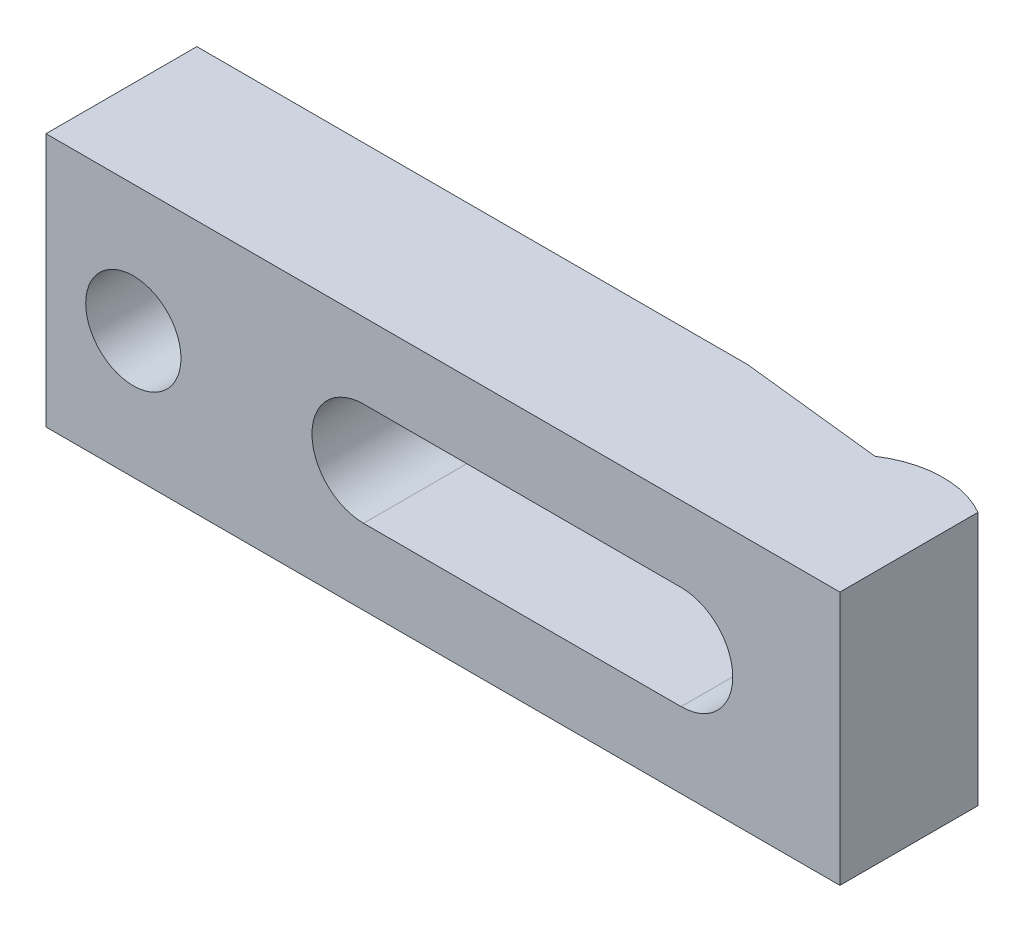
ISO-10303-21;
HEADER;
FILE_DESCRIPTION(('STEP AP214'),'2;1');
FILE_NAME('part.step','',(''),(''),'','','');
FILE_SCHEMA(('AUTOMOTIVE_DESIGN { 1 0 10303 214 1 1 1 1 }'));
ENDSEC;
DATA;
#1=APPLICATION_CONTEXT('core data for automotive mechanical design processes');
#2=APPLICATION_PROTOCOL_DEFINITION('international standard','automotive_design',2000,#1);
#3=PRODUCT_CONTEXT('',#1,'mechanical');
#4=PRODUCT('Part','Part','',(#3));
#5=PRODUCT_RELATED_PRODUCT_CATEGORY('part','',(#4));
#6=PRODUCT_DEFINITION_FORMATION('','',#4);
#7=PRODUCT_DEFINITION_CONTEXT('part definition',#1,'design');
#8=PRODUCT_DEFINITION('design','',#6,#7);
#9=PRODUCT_DEFINITION_SHAPE('','',#8);
#10=(LENGTH_UNIT() NAMED_UNIT(*) SI_UNIT(.MILLI.,.METRE.));
#11=(NAMED_UNIT(*) PLANE_ANGLE_UNIT() SI_UNIT($,.RADIAN.));
#12=(NAMED_UNIT(*) SI_UNIT($,.STERADIAN.) SOLID_ANGLE_UNIT());
#13=UNCERTAINTY_MEASURE_WITH_UNIT(LENGTH_MEASURE(1.E-05),#10,'distance_accuracy_value','');
#14=(GEOMETRIC_REPRESENTATION_CONTEXT(3) GLOBAL_UNCERTAINTY_ASSIGNED_CONTEXT((#13)) GLOBAL_UNIT_ASSIGNED_CONTEXT((#10,
#11,#12)) REPRESENTATION_CONTEXT('',''));
#15=CARTESIAN_POINT('',(0.,0.,0.));
#16=DIRECTION('',(0.,0.,1.));
#17=DIRECTION('',(1.,0.,0.));
#18=AXIS2_PLACEMENT_3D('',#15,#16,#17);
#19=CARTESIAN_POINT('',(-80.,16.,0.));
#20=DIRECTION('',(0.,0.,-1.));
#21=DIRECTION('',(-1.,0.,0.));
#22=AXIS2_PLACEMENT_3D('',#19,#20,#21);
#23=PLANE('',#22);
#24=DIRECTION('',(1.,0.,0.));
#25=VECTOR('',#24,1.);
#26=CARTESIAN_POINT('',(-40.,6.5,0.));
#27=LINE('',#26,#25);
#28=CARTESIAN_POINT('',(-80.,6.5,0.));
#29=VERTEX_POINT('',#28);
#30=CARTESIAN_POINT('',(-10.6,6.5,0.));
#31=VERTEX_POINT('',#30);
#32=EDGE_CURVE('E122',#29,#31,#27,.T.);
#33=ORIENTED_EDGE('',*,*,#32,.F.);
#34=DIRECTION('',(0.,-1.,0.));
#35=VECTOR('',#34,1.);
#36=CARTESIAN_POINT('',(-80.,16.,0.));
#37=LINE('',#36,#35);
#38=CARTESIAN_POINT('',(-80.,16.,0.));
#39=VERTEX_POINT('',#38);
#40=EDGE_CURVE('E139',#39,#29,#37,.T.);
#41=ORIENTED_EDGE('',*,*,#40,.F.);
#42=DIRECTION('',(1.,0.,0.));
#43=VECTOR('',#42,1.);
#44=CARTESIAN_POINT('',(-80.,16.,0.));
#45=LINE('',#44,#43);
#46=CARTESIAN_POINT('',(-10.6,16.,0.));
#47=VERTEX_POINT('',#46);
#48=EDGE_CURVE('E196',#39,#47,#45,.T.);
#49=ORIENTED_EDGE('',*,*,#48,.T.);
#50=DIRECTION('',(0.,-1.,0.));
#51=VECTOR('',#50,1.);
#52=CARTESIAN_POINT('',(-10.6,16.,0.));
#53=LINE('',#52,#51);
#54=EDGE_CURVE('E147',#47,#31,#53,.T.);
#55=ORIENTED_EDGE('',*,*,#54,.T.);
#56=EDGE_LOOP('',(#33,#41,#49,#55));
#57=FACE_BOUND('',#56,.T.);
#58=ADVANCED_FACE('F14',(#57),#23,.T.);
#59=CARTESIAN_POINT('',(-80.,16.,19.));
#60=DIRECTION('',(-1.,0.,0.));
#61=DIRECTION('',(0.,0.,1.));
#62=AXIS2_PLACEMENT_3D('',#59,#60,#61);
#63=PLANE('',#62);
#64=ORIENTED_EDGE('',*,*,#40,.T.);
#65=DIRECTION('',(0.,0.,1.));
#66=VECTOR('',#65,1.);
#67=CARTESIAN_POINT('',(-80.,6.5,19.));
#68=LINE('',#67,#66);
#69=CARTESIAN_POINT('',(-80.,6.5,5.));
#70=VERTEX_POINT('',#69);
#71=EDGE_CURVE('E133',#29,#70,#68,.T.);
#72=ORIENTED_EDGE('',*,*,#71,.T.);
#73=DIRECTION('',(0.,-1.,0.));
#74=VECTOR('',#73,1.);
#75=CARTESIAN_POINT('',(-80.,16.,5.));
#76=LINE('',#75,#74);
#77=CARTESIAN_POINT('',(-80.,-6.5,5.));
#78=VERTEX_POINT('',#77);
#79=EDGE_CURVE('E132',#70,#78,#76,.T.);
#80=ORIENTED_EDGE('',*,*,#79,.T.);
#81=DIRECTION('',(0.,0.,1.));
#82=VECTOR('',#81,1.);
#83=CARTESIAN_POINT('',(-80.,-6.5,19.));
#84=LINE('',#83,#82);
#85=CARTESIAN_POINT('',(-80.,-6.5,0.));
#86=VERTEX_POINT('',#85);
#87=EDGE_CURVE('E115',#86,#78,#84,.T.);
#88=ORIENTED_EDGE('',*,*,#87,.F.);
#89=CARTESIAN_POINT('',(-80.,-16.,0.));
#90=VERTEX_POINT('',#89);
#91=EDGE_CURVE('E129',#86,#90,#37,.T.);
#92=ORIENTED_EDGE('',*,*,#91,.T.);
#93=DIRECTION('',(0.,0.,-1.));
#94=VECTOR('',#93,1.);
#95=CARTESIAN_POINT('',(-80.,-16.,19.));
#96=LINE('',#95,#94);
#97=CARTESIAN_POINT('',(-80.,-16.,19.));
#98=VERTEX_POINT('',#97);
#99=EDGE_CURVE('E169',#98,#90,#96,.T.);
#100=ORIENTED_EDGE('',*,*,#99,.F.);
#101=DIRECTION('',(0.,-1.,0.));
#102=VECTOR('',#101,1.);
#103=CARTESIAN_POINT('',(-80.,16.,19.));
#104=LINE('',#103,#102);
#105=CARTESIAN_POINT('',(-80.,16.,19.));
#106=VERTEX_POINT('',#105);
#107=EDGE_CURVE('E140',#106,#98,#104,.T.);
#108=ORIENTED_EDGE('',*,*,#107,.F.);
#109=DIRECTION('',(0.,0.,-1.));
#110=VECTOR('',#109,1.);
#111=CARTESIAN_POINT('',(-80.,16.,19.));
#112=LINE('',#111,#110);
#113=EDGE_CURVE('E179',#106,#39,#112,.T.);
#114=ORIENTED_EDGE('',*,*,#113,.T.);
#115=EDGE_LOOP('',(#64,#72,#80,#88,#92,#100,#108,#114));
#116=FACE_BOUND('',#115,.T.);
#117=ADVANCED_FACE('F127',(#116),#63,.T.);
#118=CARTESIAN_POINT('',(-40.,0.,19.));
#119=DIRECTION('',(0.,0.,-1.));
#120=DIRECTION('',(-1.,0.,0.));
#121=AXIS2_PLACEMENT_3D('',#118,#119,#120);
#122=CYLINDRICAL_SURFACE('',#121,6.5);
#123=DIRECTION('',(0.,0.,-1.));
#124=VECTOR('',#123,1.);
#125=CARTESIAN_POINT('',(-40.,-6.5,19.));
#126=LINE('',#125,#124);
#127=CARTESIAN_POINT('',(-40.,-6.5,19.));
#128=VERTEX_POINT('',#127);
#129=CARTESIAN_POINT('',(-40.,-6.5,5.));
#130=VERTEX_POINT('',#129);
#131=EDGE_CURVE('E229',#128,#130,#126,.T.);
#132=ORIENTED_EDGE('',*,*,#131,.T.);
#133=CARTESIAN_POINT('',(-40.,0.,5.));
#134=DIRECTION('',(0.,0.,-1.));
#135=DIRECTION('',(-1.,0.,0.));
#136=AXIS2_PLACEMENT_3D('',#133,#134,#135);
#137=CIRCLE('',#136,6.5);
#138=CARTESIAN_POINT('',(-40.,6.5,5.));
#139=VERTEX_POINT('',#138);
#140=EDGE_CURVE('E245',#130,#139,#137,.T.);
#141=ORIENTED_EDGE('',*,*,#140,.T.);
#142=DIRECTION('',(0.,0.,-1.));
#143=VECTOR('',#142,1.);
#144=CARTESIAN_POINT('',(-40.,6.5,19.));
#145=LINE('',#144,#143);
#146=CARTESIAN_POINT('',(-40.,6.5,19.));
#147=VERTEX_POINT('',#146);
#148=EDGE_CURVE('E231',#147,#139,#145,.T.);
#149=ORIENTED_EDGE('',*,*,#148,.F.);
#150=CARTESIAN_POINT('',(-40.,0.,19.));
#151=DIRECTION('',(0.,0.,1.));
#152=DIRECTION('',(1.,0.,0.));
#153=AXIS2_PLACEMENT_3D('',#150,#151,#152);
#154=CIRCLE('',#153,6.5);
#155=EDGE_CURVE('E38',#147,#128,#154,.T.);
#156=ORIENTED_EDGE('',*,*,#155,.T.);
#157=EDGE_LOOP('',(#132,#141,#149,#156));
#158=FACE_BOUND('',#157,.T.);
#159=ADVANCED_FACE('F244',(#158),#122,.F.);
#160=CARTESIAN_POINT('',(-69.,0.,19.));
#161=DIRECTION('',(0.,0.,-1.));
#162=DIRECTION('',(-1.,0.,0.));
#163=AXIS2_PLACEMENT_3D('',#160,#161,#162);
#164=CYLINDRICAL_SURFACE('',#163,6.);
#165=CARTESIAN_POINT('',(-69.,0.,19.));
#166=DIRECTION('',(0.,0.,1.));
#167=DIRECTION('',(1.,0.,0.));
#168=AXIS2_PLACEMENT_3D('',#165,#166,#167);
#169=CIRCLE('',#168,6.);
#170=CARTESIAN_POINT('',(-63.,0.,19.));
#171=VERTEX_POINT('',#170);
#172=EDGE_CURVE('E209',#171,#171,#169,.T.);
#173=ORIENTED_EDGE('',*,*,#172,.T.);
#174=EDGE_LOOP('',(#173));
#175=FACE_BOUND('',#174,.T.);
#176=CARTESIAN_POINT('',(-69.,0.,5.));
#177=DIRECTION('',(0.,0.,-1.));
#178=DIRECTION('',(-1.,0.,0.));
#179=AXIS2_PLACEMENT_3D('',#176,#177,#178);
#180=CIRCLE('',#179,6.);
#181=CARTESIAN_POINT('',(-75.,0.,5.));
#182=VERTEX_POINT('',#181);
#183=EDGE_CURVE('E18',#182,#182,#180,.T.);
#184=ORIENTED_EDGE('',*,*,#183,.T.);
#185=EDGE_LOOP('',(#184));
#186=FACE_BOUND('',#185,.T.);
#187=ADVANCED_FACE('F278',(#175,#186),#164,.F.);
#188=CARTESIAN_POINT('',(20.,16.,19.));
#189=DIRECTION('',(0.,0.,1.));
#190=DIRECTION('',(1.,0.,0.));
#191=AXIS2_PLACEMENT_3D('',#188,#189,#190);
#192=PLANE('',#191);
#193=DIRECTION('',(1.,0.,0.));
#194=VECTOR('',#193,1.);
#195=CARTESIAN_POINT('',(-40.,6.5,19.));
#196=LINE('',#195,#194);
#197=CARTESIAN_POINT('',(0.,6.5,19.));
#198=VERTEX_POINT('',#197);
#199=EDGE_CURVE('E223',#147,#198,#196,.T.);
#200=ORIENTED_EDGE('',*,*,#199,.T.);
#201=CARTESIAN_POINT('',(0.,0.,19.));
#202=DIRECTION('',(0.,0.,1.));
#203=DIRECTION('',(1.,0.,0.));
#204=AXIS2_PLACEMENT_3D('',#201,#202,#203);
#205=CIRCLE('',#204,6.5);
#206=CARTESIAN_POINT('',(0.,-6.5,19.));
#207=VERTEX_POINT('',#206);
#208=EDGE_CURVE('E121',#207,#198,#205,.T.);
#209=ORIENTED_EDGE('',*,*,#208,.F.);
#210=DIRECTION('',(-1.,0.,0.));
#211=VECTOR('',#210,1.);
#212=CARTESIAN_POINT('',(0.,-6.5,19.));
#213=LINE('',#212,#211);
#214=EDGE_CURVE('E218',#207,#128,#213,.T.);
#215=ORIENTED_EDGE('',*,*,#214,.T.);
#216=ORIENTED_EDGE('',*,*,#155,.F.);
#217=EDGE_LOOP('',(#200,#209,#215,#216));
#218=FACE_BOUND('',#217,.T.);
#219=DIRECTION('',(0.,-1.,0.));
#220=VECTOR('',#219,1.);
#221=CARTESIAN_POINT('',(20.,16.,19.));
#222=LINE('',#221,#220);
#223=CARTESIAN_POINT('',(20.,16.,19.));
#224=VERTEX_POINT('',#223);
#225=CARTESIAN_POINT('',(20.,-16.,19.));
#226=VERTEX_POINT('',#225);
#227=EDGE_CURVE('E23',#224,#226,#222,.T.);
#228=ORIENTED_EDGE('',*,*,#227,.F.);
#229=DIRECTION('',(-1.,0.,0.));
#230=VECTOR('',#229,1.);
#231=CARTESIAN_POINT('',(20.,16.,19.));
#232=LINE('',#231,#230);
#233=EDGE_CURVE('E177',#224,#106,#232,.T.);
#234=ORIENTED_EDGE('',*,*,#233,.T.);
#235=ORIENTED_EDGE('',*,*,#107,.T.);
#236=DIRECTION('',(-1.,0.,0.));
#237=VECTOR('',#236,1.);
#238=CARTESIAN_POINT('',(20.,-16.,19.));
#239=LINE('',#238,#237);
#240=EDGE_CURVE('E165',#226,#98,#239,.T.);
#241=ORIENTED_EDGE('',*,*,#240,.F.);
#242=EDGE_LOOP('',(#228,#234,#235,#241));
#243=FACE_BOUND('',#242,.T.);
#244=ORIENTED_EDGE('',*,*,#172,.F.);
#245=EDGE_LOOP('',(#244));
#246=FACE_BOUND('',#245,.T.);
#247=ADVANCED_FACE('F166',(#218,#243,#246),#192,.T.);
#248=ORIENTED_EDGE('',*,*,#91,.F.);
#249=DIRECTION('',(-1.,0.,0.));
#250=VECTOR('',#249,1.);
#251=CARTESIAN_POINT('',(0.,-6.5,0.));
#252=LINE('',#251,#250);
#253=CARTESIAN_POINT('',(-10.6,-6.5,0.));
#254=VERTEX_POINT('',#253);
#255=EDGE_CURVE('E110',#254,#86,#252,.T.);
#256=ORIENTED_EDGE('',*,*,#255,.F.);
#257=CARTESIAN_POINT('',(-10.6,-16.,0.));
#258=VERTEX_POINT('',#257);
#259=EDGE_CURVE('E142',#254,#258,#53,.T.);
#260=ORIENTED_EDGE('',*,*,#259,.T.);
#261=DIRECTION('',(1.,0.,0.));
#262=VECTOR('',#261,1.);
#263=CARTESIAN_POINT('',(-80.,-16.,0.));
#264=LINE('',#263,#262);
#265=EDGE_CURVE('E138',#90,#258,#264,.T.);
#266=ORIENTED_EDGE('',*,*,#265,.F.);
#267=EDGE_LOOP('',(#248,#256,#260,#266));
#268=FACE_BOUND('',#267,.T.);
#269=ADVANCED_FACE('F136',(#268),#23,.T.);
#270=CARTESIAN_POINT('',(20.,16.,19.));
#271=DIRECTION('',(-1.,0.,0.));
#272=DIRECTION('',(0.,0.,1.));
#273=AXIS2_PLACEMENT_3D('',#270,#271,#272);
#274=PLANE('',#273);
#275=DIRECTION('',(0.,-1.,0.));
#276=VECTOR('',#275,1.);
#277=CARTESIAN_POINT('',(20.,16.,1.60769515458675));
#278=LINE('',#277,#276);
#279=CARTESIAN_POINT('',(20.,16.,1.60769515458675));
#280=VERTEX_POINT('',#279);
#281=CARTESIAN_POINT('',(20.,-16.,1.60769515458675));
#282=VERTEX_POINT('',#281);
#283=EDGE_CURVE('E152',#280,#282,#278,.T.);
#284=ORIENTED_EDGE('',*,*,#283,.F.);
#285=DIRECTION('',(0.,0.,-1.));
#286=VECTOR('',#285,1.);
#287=CARTESIAN_POINT('',(20.,16.,19.));
#288=LINE('',#287,#286);
#289=EDGE_CURVE('E143',#224,#280,#288,.T.);
#290=ORIENTED_EDGE('',*,*,#289,.F.);
#291=ORIENTED_EDGE('',*,*,#227,.T.);
#292=DIRECTION('',(0.,0.,-1.));
#293=VECTOR('',#292,1.);
#294=CARTESIAN_POINT('',(20.,-16.,19.));
#295=LINE('',#294,#293);
#296=EDGE_CURVE('E159',#226,#282,#295,.T.);
#297=ORIENTED_EDGE('',*,*,#296,.T.);
#298=EDGE_LOOP('',(#284,#290,#291,#297));
#299=FACE_BOUND('',#298,.T.);
#300=ADVANCED_FACE('F16',(#299),#274,.F.);
#301=CARTESIAN_POINT('',(14.,16.,12.));
#302=DIRECTION('',(0.,-1.,0.));
#303=DIRECTION('',(0.,0.,-1.));
#304=AXIS2_PLACEMENT_3D('',#301,#302,#303);
#305=CYLINDRICAL_SURFACE('',#304,12.);
#306=DIRECTION('',(0.,-1.,0.));
#307=VECTOR('',#306,1.);
#308=CARTESIAN_POINT('',(7.4,16.,1.97802414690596));
#309=LINE('',#308,#307);
#310=CARTESIAN_POINT('',(7.4,16.,1.97802414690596));
#311=VERTEX_POINT('',#310);
#312=CARTESIAN_POINT('',(7.4,-16.,1.97802414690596));
#313=VERTEX_POINT('',#312);
#314=EDGE_CURVE('E150',#311,#313,#309,.T.);
#315=ORIENTED_EDGE('',*,*,#314,.F.);
#316=CARTESIAN_POINT('',(14.,16.,12.));
#317=DIRECTION('',(0.,1.,0.));
#318=DIRECTION('',(0.,0.,1.));
#319=AXIS2_PLACEMENT_3D('',#316,#317,#318);
#320=CIRCLE('',#319,12.);
#321=EDGE_CURVE('E190',#280,#311,#320,.T.);
#322=ORIENTED_EDGE('',*,*,#321,.F.);
#323=ORIENTED_EDGE('',*,*,#283,.T.);
#324=CARTESIAN_POINT('',(14.,-16.,12.));
#325=DIRECTION('',(0.,1.,0.));
#326=DIRECTION('',(0.,0.,1.));
#327=AXIS2_PLACEMENT_3D('',#324,#325,#326);
#328=CIRCLE('',#327,12.);
#329=EDGE_CURVE('E176',#282,#313,#328,.T.);
#330=ORIENTED_EDGE('',*,*,#329,.T.);
#331=EDGE_LOOP('',(#315,#322,#323,#330));
#332=FACE_BOUND('',#331,.T.);
#333=ADVANCED_FACE('F277',(#332),#305,.T.);
#334=CARTESIAN_POINT('',(7.4,16.,1.97802414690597));
#335=DIRECTION('',(-0.109232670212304,0.,0.99401620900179));
#336=DIRECTION('',(0.99401620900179,0.,0.109232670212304));
#337=AXIS2_PLACEMENT_3D('',#334,#335,#336);
#338=PLANE('',#337);
#339=CARTESIAN_POINT('',(0.,0.,1.16483644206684));
#340=DIRECTION('',(-0.109232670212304,0.,0.99401620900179));
#341=DIRECTION('',(-0.99401620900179,0.,-0.109232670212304));
#342=AXIS2_PLACEMENT_3D('',#339,#340,#341);
#343=ELLIPSE('',#342,6.53912877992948,6.5);
#344=CARTESIAN_POINT('',(0.,6.5,1.16483644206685));
#345=VERTEX_POINT('',#344);
#346=CARTESIAN_POINT('',(0.,-6.5,1.16483644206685));
#347=VERTEX_POINT('',#346);
#348=EDGE_CURVE('E9',#345,#347,#343,.F.);
#349=ORIENTED_EDGE('',*,*,#348,.F.);
#350=DIRECTION('',(-0.99401620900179,0.,-0.109232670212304));
#351=VECTOR('',#350,1.);
#352=CARTESIAN_POINT('',(7.4,6.5,1.97802414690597));
#353=LINE('',#352,#351);
#354=EDGE_CURVE('E170',#345,#31,#353,.T.);
#355=ORIENTED_EDGE('',*,*,#354,.T.);
#356=ORIENTED_EDGE('',*,*,#54,.F.);
#357=DIRECTION('',(-0.99401620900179,0.,-0.109232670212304));
#358=VECTOR('',#357,1.);
#359=CARTESIAN_POINT('',(7.4,16.,1.97802414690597));
#360=LINE('',#359,#358);
#361=EDGE_CURVE('E193',#311,#47,#360,.T.);
#362=ORIENTED_EDGE('',*,*,#361,.F.);
#363=ORIENTED_EDGE('',*,*,#314,.T.);
#364=DIRECTION('',(-0.99401620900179,0.,-0.109232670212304));
#365=VECTOR('',#364,1.);
#366=CARTESIAN_POINT('',(7.4,-16.,1.97802414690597));
#367=LINE('',#366,#365);
#368=EDGE_CURVE('E180',#313,#258,#367,.T.);
#369=ORIENTED_EDGE('',*,*,#368,.T.);
#370=ORIENTED_EDGE('',*,*,#259,.F.);
#371=DIRECTION('',(0.99401620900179,0.,0.109232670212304));
#372=VECTOR('',#371,1.);
#373=CARTESIAN_POINT('',(7.4,-6.5,1.97802414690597));
#374=LINE('',#373,#372);
#375=EDGE_CURVE('E117',#254,#347,#374,.T.);
#376=ORIENTED_EDGE('',*,*,#375,.T.);
#377=EDGE_LOOP('',(#349,#355,#356,#362,#363,#369,#370,#376));
#378=FACE_BOUND('',#377,.T.);
#379=ADVANCED_FACE('F237',(#378),#338,.F.);
#380=CARTESIAN_POINT('',(14.,16.,12.));
#381=DIRECTION('',(0.,1.,0.));
#382=DIRECTION('',(0.,0.,1.));
#383=AXIS2_PLACEMENT_3D('',#380,#381,#382);
#384=PLANE('',#383);
#385=ORIENTED_EDGE('',*,*,#233,.F.);
#386=ORIENTED_EDGE('',*,*,#289,.T.);
#387=ORIENTED_EDGE('',*,*,#321,.T.);
#388=ORIENTED_EDGE('',*,*,#361,.T.);
#389=ORIENTED_EDGE('',*,*,#48,.F.);
#390=ORIENTED_EDGE('',*,*,#113,.F.);
#391=EDGE_LOOP('',(#385,#386,#387,#388,#389,#390));
#392=FACE_BOUND('',#391,.T.);
#393=ADVANCED_FACE('F203',(#392),#384,.T.);
#394=CARTESIAN_POINT('',(14.,-16.,12.));
#395=DIRECTION('',(0.,1.,0.));
#396=DIRECTION('',(0.,0.,1.));
#397=AXIS2_PLACEMENT_3D('',#394,#395,#396);
#398=PLANE('',#397);
#399=ORIENTED_EDGE('',*,*,#240,.T.);
#400=ORIENTED_EDGE('',*,*,#99,.T.);
#401=ORIENTED_EDGE('',*,*,#265,.T.);
#402=ORIENTED_EDGE('',*,*,#368,.F.);
#403=ORIENTED_EDGE('',*,*,#329,.F.);
#404=ORIENTED_EDGE('',*,*,#296,.F.);
#405=EDGE_LOOP('',(#399,#400,#401,#402,#403,#404));
#406=FACE_BOUND('',#405,.T.);
#407=ADVANCED_FACE('F173',(#406),#398,.F.);
#408=CARTESIAN_POINT('',(0.,0.,19.));
#409=DIRECTION('',(0.,0.,-1.));
#410=DIRECTION('',(-1.,0.,0.));
#411=AXIS2_PLACEMENT_3D('',#408,#409,#410);
#412=CYLINDRICAL_SURFACE('',#411,6.5);
#413=ORIENTED_EDGE('',*,*,#348,.T.);
#414=DIRECTION('',(0.,0.,-1.));
#415=VECTOR('',#414,1.);
#416=CARTESIAN_POINT('',(0.,-6.5,19.));
#417=LINE('',#416,#415);
#418=EDGE_CURVE('E221',#207,#347,#417,.T.);
#419=ORIENTED_EDGE('',*,*,#418,.F.);
#420=ORIENTED_EDGE('',*,*,#208,.T.);
#421=DIRECTION('',(0.,0.,-1.));
#422=VECTOR('',#421,1.);
#423=CARTESIAN_POINT('',(0.,6.5,19.));
#424=LINE('',#423,#422);
#425=EDGE_CURVE('E233',#198,#345,#424,.T.);
#426=ORIENTED_EDGE('',*,*,#425,.T.);
#427=EDGE_LOOP('',(#413,#419,#420,#426));
#428=FACE_BOUND('',#427,.T.);
#429=ADVANCED_FACE('F240',(#428),#412,.F.);
#430=CARTESIAN_POINT('',(-40.,6.5,19.));
#431=DIRECTION('',(0.,1.,0.));
#432=DIRECTION('',(-1.,0.,0.));
#433=AXIS2_PLACEMENT_3D('',#430,#431,#432);
#434=PLANE('',#433);
#435=ORIENTED_EDGE('',*,*,#32,.T.);
#436=ORIENTED_EDGE('',*,*,#354,.F.);
#437=ORIENTED_EDGE('',*,*,#425,.F.);
#438=ORIENTED_EDGE('',*,*,#199,.F.);
#439=ORIENTED_EDGE('',*,*,#148,.T.);
#440=DIRECTION('',(-1.,0.,0.));
#441=VECTOR('',#440,1.);
#442=CARTESIAN_POINT('',(-10.,6.5,5.));
#443=LINE('',#442,#441);
#444=EDGE_CURVE('E30',#139,#70,#443,.T.);
#445=ORIENTED_EDGE('',*,*,#444,.T.);
#446=ORIENTED_EDGE('',*,*,#71,.F.);
#447=EDGE_LOOP('',(#435,#436,#437,#438,#439,#445,#446));
#448=FACE_BOUND('',#447,.T.);
#449=ADVANCED_FACE('F211',(#448),#434,.F.);
#450=CARTESIAN_POINT('',(0.,-6.5,19.));
#451=DIRECTION('',(0.,-1.,0.));
#452=DIRECTION('',(1.,0.,0.));
#453=AXIS2_PLACEMENT_3D('',#450,#451,#452);
#454=PLANE('',#453);
#455=ORIENTED_EDGE('',*,*,#418,.T.);
#456=ORIENTED_EDGE('',*,*,#375,.F.);
#457=ORIENTED_EDGE('',*,*,#255,.T.);
#458=ORIENTED_EDGE('',*,*,#87,.T.);
#459=DIRECTION('',(-1.,0.,0.));
#460=VECTOR('',#459,1.);
#461=CARTESIAN_POINT('',(-10.,-6.5,5.));
#462=LINE('',#461,#460);
#463=EDGE_CURVE('E249',#130,#78,#462,.T.);
#464=ORIENTED_EDGE('',*,*,#463,.F.);
#465=ORIENTED_EDGE('',*,*,#131,.F.);
#466=ORIENTED_EDGE('',*,*,#214,.F.);
#467=EDGE_LOOP('',(#455,#456,#457,#458,#464,#465,#466));
#468=FACE_BOUND('',#467,.T.);
#469=ADVANCED_FACE('F113',(#468),#454,.F.);
#470=CARTESIAN_POINT('',(-10.,6.5,5.));
#471=DIRECTION('',(0.,0.,-1.));
#472=DIRECTION('',(-1.,0.,0.));
#473=AXIS2_PLACEMENT_3D('',#470,#471,#472);
#474=PLANE('',#473);
#475=ORIENTED_EDGE('',*,*,#183,.F.);
#476=EDGE_LOOP('',(#475));
#477=FACE_BOUND('',#476,.T.);
#478=ORIENTED_EDGE('',*,*,#444,.F.);
#479=ORIENTED_EDGE('',*,*,#140,.F.);
#480=ORIENTED_EDGE('',*,*,#463,.T.);
#481=ORIENTED_EDGE('',*,*,#79,.F.);
#482=EDGE_LOOP('',(#478,#479,#480,#481));
#483=FACE_BOUND('',#482,.T.);
#484=ADVANCED_FACE('F251',(#477,#483),#474,.T.);
#485=CLOSED_SHELL('',(#58,#117,#159,#187,#247,#269,#300,#333,#379,#393,#407,#429,#449,#469,#484));
#486=MANIFOLD_SOLID_BREP('B1',#485);
#487=ADVANCED_BREP_SHAPE_REPRESENTATION('',(#18,#486),#14);
#488=SHAPE_DEFINITION_REPRESENTATION(#9,#487);
ENDSEC;
END-ISO-10303-21;
